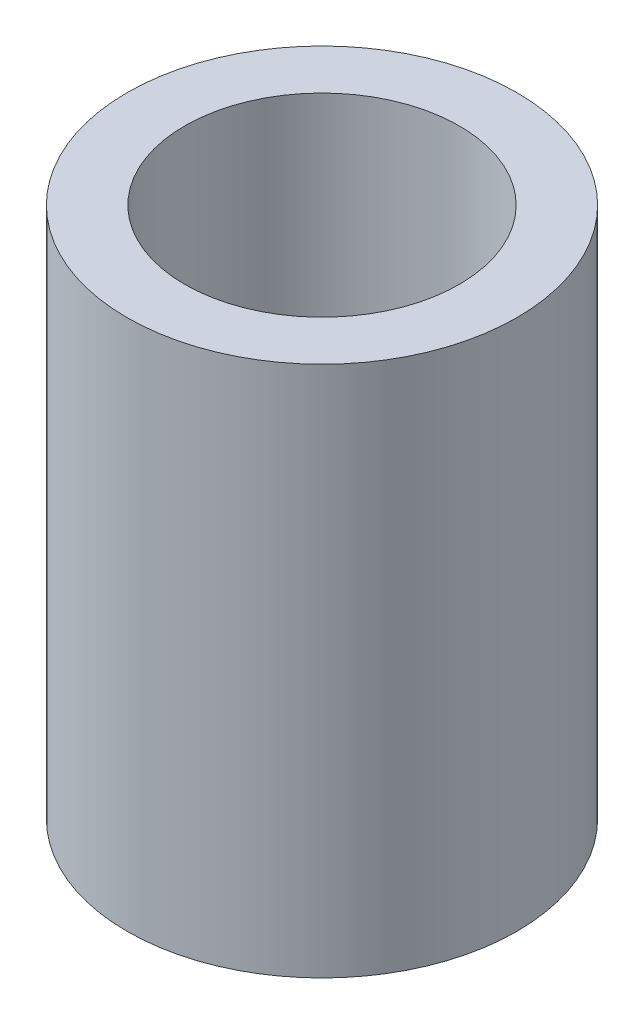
ISO-10303-21;
HEADER;
FILE_DESCRIPTION(('STEP AP214'),'2;1');
FILE_NAME('part.step','',(''),(''),'','','');
FILE_SCHEMA(('AUTOMOTIVE_DESIGN { 1 0 10303 214 1 1 1 1 }'));
ENDSEC;
DATA;
#1=APPLICATION_CONTEXT('core data for automotive mechanical design processes');
#2=APPLICATION_PROTOCOL_DEFINITION('international standard','automotive_design',2000,#1);
#3=PRODUCT_CONTEXT('',#1,'mechanical');
#4=PRODUCT('Part','Part','',(#3));
#5=PRODUCT_RELATED_PRODUCT_CATEGORY('part','',(#4));
#6=PRODUCT_DEFINITION_FORMATION('','',#4);
#7=PRODUCT_DEFINITION_CONTEXT('part definition',#1,'design');
#8=PRODUCT_DEFINITION('design','',#6,#7);
#9=PRODUCT_DEFINITION_SHAPE('','',#8);
#10=(LENGTH_UNIT() NAMED_UNIT(*) SI_UNIT(.MILLI.,.METRE.));
#11=(NAMED_UNIT(*) PLANE_ANGLE_UNIT() SI_UNIT($,.RADIAN.));
#12=(NAMED_UNIT(*) SI_UNIT($,.STERADIAN.) SOLID_ANGLE_UNIT());
#13=UNCERTAINTY_MEASURE_WITH_UNIT(LENGTH_MEASURE(1.E-05),#10,'distance_accuracy_value','');
#14=(GEOMETRIC_REPRESENTATION_CONTEXT(3) GLOBAL_UNCERTAINTY_ASSIGNED_CONTEXT((#13)) GLOBAL_UNIT_ASSIGNED_CONTEXT((#10,
#11,#12)) REPRESENTATION_CONTEXT('',''));
#15=CARTESIAN_POINT('',(0.,0.,0.));
#16=DIRECTION('',(0.,0.,1.));
#17=DIRECTION('',(1.,0.,0.));
#18=AXIS2_PLACEMENT_3D('',#15,#16,#17);
#19=CARTESIAN_POINT('',(0.,30.,0.));
#20=DIRECTION('',(0.,1.,0.));
#21=DIRECTION('',(0.,0.,1.));
#22=AXIS2_PLACEMENT_3D('',#19,#20,#21);
#23=PLANE('',#22);
#24=CARTESIAN_POINT('',(0.,30.,0.));
#25=DIRECTION('',(0.,1.,0.));
#26=DIRECTION('',(0.,0.,1.));
#27=AXIS2_PLACEMENT_3D('',#24,#25,#26);
#28=CIRCLE('',#27,11.);
#29=CARTESIAN_POINT('',(0.,30.,11.));
#30=VERTEX_POINT('',#29);
#31=EDGE_CURVE('E10',#30,#30,#28,.T.);
#32=ORIENTED_EDGE('',*,*,#31,.T.);
#33=EDGE_LOOP('',(#32));
#34=FACE_BOUND('',#33,.T.);
#35=CARTESIAN_POINT('',(0.,30.,0.));
#36=DIRECTION('',(0.,1.,0.));
#37=DIRECTION('',(0.,0.,1.));
#38=AXIS2_PLACEMENT_3D('',#35,#36,#37);
#39=CIRCLE('',#38,7.75);
#40=CARTESIAN_POINT('',(0.,30.,7.75));
#41=VERTEX_POINT('',#40);
#42=EDGE_CURVE('E39',#41,#41,#39,.T.);
#43=ORIENTED_EDGE('',*,*,#42,.F.);
#44=EDGE_LOOP('',(#43));
#45=FACE_BOUND('',#44,.T.);
#46=ADVANCED_FACE('F28',(#34,#45),#23,.T.);
#47=CARTESIAN_POINT('',(0.,0.,0.));
#48=DIRECTION('',(0.,1.,0.));
#49=DIRECTION('',(0.,0.,1.));
#50=AXIS2_PLACEMENT_3D('',#47,#48,#49);
#51=PLANE('',#50);
#52=CARTESIAN_POINT('',(0.,0.,0.));
#53=DIRECTION('',(0.,1.,0.));
#54=DIRECTION('',(0.,0.,1.));
#55=AXIS2_PLACEMENT_3D('',#52,#53,#54);
#56=CIRCLE('',#55,11.);
#57=CARTESIAN_POINT('',(0.,0.,11.));
#58=VERTEX_POINT('',#57);
#59=EDGE_CURVE('E35',#58,#58,#56,.T.);
#60=ORIENTED_EDGE('',*,*,#59,.F.);
#61=EDGE_LOOP('',(#60));
#62=FACE_BOUND('',#61,.T.);
#63=CARTESIAN_POINT('',(0.,0.,0.));
#64=DIRECTION('',(0.,1.,0.));
#65=DIRECTION('',(0.,0.,1.));
#66=AXIS2_PLACEMENT_3D('',#63,#64,#65);
#67=CIRCLE('',#66,7.75);
#68=CARTESIAN_POINT('',(0.,0.,7.75));
#69=VERTEX_POINT('',#68);
#70=EDGE_CURVE('E43',#69,#69,#67,.T.);
#71=ORIENTED_EDGE('',*,*,#70,.T.);
#72=EDGE_LOOP('',(#71));
#73=FACE_BOUND('',#72,.T.);
#74=ADVANCED_FACE('F49',(#62,#73),#51,.F.);
#75=CARTESIAN_POINT('',(0.,30.,0.));
#76=DIRECTION('',(0.,-1.,0.));
#77=DIRECTION('',(0.,0.,-1.));
#78=AXIS2_PLACEMENT_3D('',#75,#76,#77);
#79=CYLINDRICAL_SURFACE('',#78,11.);
#80=ORIENTED_EDGE('',*,*,#31,.F.);
#81=EDGE_LOOP('',(#80));
#82=FACE_BOUND('',#81,.T.);
#83=ORIENTED_EDGE('',*,*,#59,.T.);
#84=EDGE_LOOP('',(#83));
#85=FACE_BOUND('',#84,.T.);
#86=ADVANCED_FACE('F30',(#82,#85),#79,.T.);
#87=CARTESIAN_POINT('',(0.,30.,0.));
#88=DIRECTION('',(0.,-1.,0.));
#89=DIRECTION('',(0.,0.,-1.));
#90=AXIS2_PLACEMENT_3D('',#87,#88,#89);
#91=CYLINDRICAL_SURFACE('',#90,7.75);
#92=ORIENTED_EDGE('',*,*,#42,.T.);
#93=EDGE_LOOP('',(#92));
#94=FACE_BOUND('',#93,.T.);
#95=ORIENTED_EDGE('',*,*,#70,.F.);
#96=EDGE_LOOP('',(#95));
#97=FACE_BOUND('',#96,.T.);
#98=ADVANCED_FACE('F51',(#94,#97),#91,.F.);
#99=CLOSED_SHELL('',(#46,#74,#86,#98));
#100=MANIFOLD_SOLID_BREP('B2',#99);
#101=ADVANCED_BREP_SHAPE_REPRESENTATION('',(#18,#100),#14);
#102=SHAPE_DEFINITION_REPRESENTATION(#9,#101);
ENDSEC;
END-ISO-10303-21;
